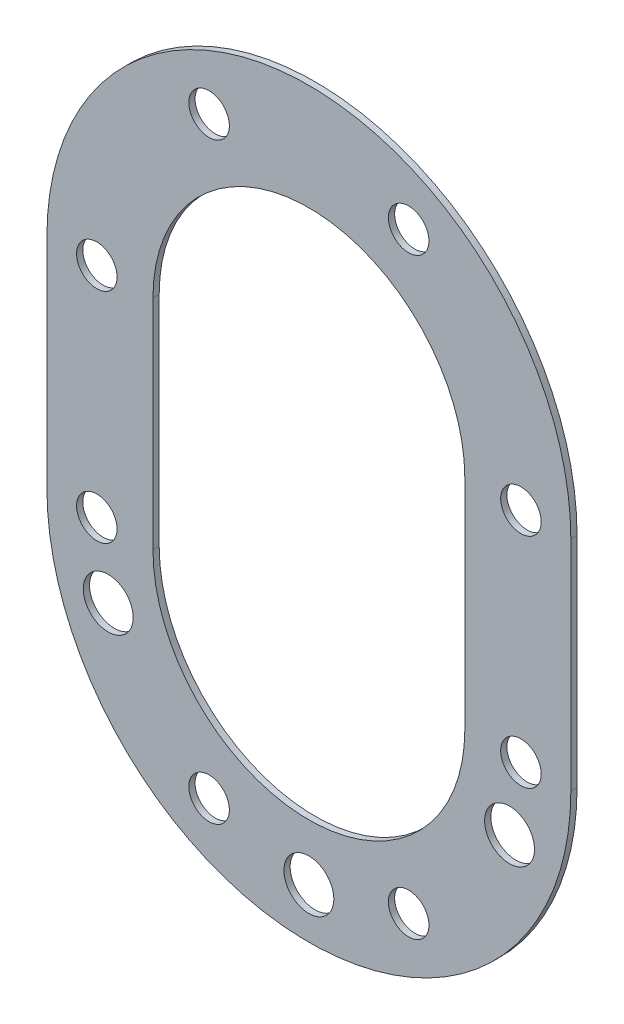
ISO-10303-21;
HEADER;
FILE_DESCRIPTION(('STEP AP214'),'2;1');
FILE_NAME('part.step','',(''),(''),'','','');
FILE_SCHEMA(('AUTOMOTIVE_DESIGN { 1 0 10303 214 1 1 1 1 }'));
ENDSEC;
DATA;
#1=APPLICATION_CONTEXT('core data for automotive mechanical design processes');
#2=APPLICATION_PROTOCOL_DEFINITION('international standard','automotive_design',2000,#1);
#3=PRODUCT_CONTEXT('',#1,'mechanical');
#4=PRODUCT('Part','Part','',(#3));
#5=PRODUCT_RELATED_PRODUCT_CATEGORY('part','',(#4));
#6=PRODUCT_DEFINITION_FORMATION('','',#4);
#7=PRODUCT_DEFINITION_CONTEXT('part definition',#1,'design');
#8=PRODUCT_DEFINITION('design','',#6,#7);
#9=PRODUCT_DEFINITION_SHAPE('','',#8);
#10=(LENGTH_UNIT() NAMED_UNIT(*) SI_UNIT(.MILLI.,.METRE.));
#11=(NAMED_UNIT(*) PLANE_ANGLE_UNIT() SI_UNIT($,.RADIAN.));
#12=(NAMED_UNIT(*) SI_UNIT($,.STERADIAN.) SOLID_ANGLE_UNIT());
#13=UNCERTAINTY_MEASURE_WITH_UNIT(LENGTH_MEASURE(1.E-05),#10,'distance_accuracy_value','');
#14=(GEOMETRIC_REPRESENTATION_CONTEXT(3) GLOBAL_UNCERTAINTY_ASSIGNED_CONTEXT((#13)) GLOBAL_UNIT_ASSIGNED_CONTEXT((#10,
#11,#12)) REPRESENTATION_CONTEXT('',''));
#15=CARTESIAN_POINT('',(0.,0.,0.));
#16=DIRECTION('',(0.,0.,1.));
#17=DIRECTION('',(1.,0.,0.));
#18=AXIS2_PLACEMENT_3D('',#15,#16,#17);
#19=CARTESIAN_POINT('',(0.,0.,1.));
#20=DIRECTION('',(0.,0.,1.));
#21=DIRECTION('',(1.,0.,0.));
#22=AXIS2_PLACEMENT_3D('',#19,#20,#21);
#23=PLANE('',#22);
#24=CARTESIAN_POINT('',(0.,-69.,1.));
#25=DIRECTION('',(0.,0.,1.));
#26=DIRECTION('',(1.,0.,0.));
#27=AXIS2_PLACEMENT_3D('',#24,#25,#26);
#28=CIRCLE('',#27,4.);
#29=CARTESIAN_POINT('',(4.00000000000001,-69.,1.));
#30=VERTEX_POINT('',#29);
#31=EDGE_CURVE('E275',#30,#30,#28,.T.);
#32=ORIENTED_EDGE('',*,*,#31,.F.);
#33=EDGE_LOOP('',(#32));
#34=FACE_BOUND('',#33,.T.);
#35=CARTESIAN_POINT('',(34.,-35.,1.));
#36=DIRECTION('',(0.,0.,1.));
#37=DIRECTION('',(1.,0.,0.));
#38=AXIS2_PLACEMENT_3D('',#35,#36,#37);
#39=CIRCLE('',#38,3.25);
#40=CARTESIAN_POINT('',(37.25,-35.,1.));
#41=VERTEX_POINT('',#40);
#42=EDGE_CURVE('E284',#41,#41,#39,.T.);
#43=ORIENTED_EDGE('',*,*,#42,.F.);
#44=EDGE_LOOP('',(#43));
#45=FACE_BOUND('',#44,.T.);
#46=CARTESIAN_POINT('',(-34.,0.,1.));
#47=DIRECTION('',(0.,0.,1.));
#48=DIRECTION('',(1.,0.,0.));
#49=AXIS2_PLACEMENT_3D('',#46,#47,#48);
#50=CIRCLE('',#49,3.25);
#51=CARTESIAN_POINT('',(-30.75,0.,1.));
#52=VERTEX_POINT('',#51);
#53=EDGE_CURVE('E298',#52,#52,#50,.T.);
#54=ORIENTED_EDGE('',*,*,#53,.F.);
#55=EDGE_LOOP('',(#54));
#56=FACE_BOUND('',#55,.T.);
#57=CARTESIAN_POINT('',(-16.,-65.,1.));
#58=DIRECTION('',(0.,0.,1.));
#59=DIRECTION('',(1.,0.,0.));
#60=AXIS2_PLACEMENT_3D('',#57,#58,#59);
#61=CIRCLE('',#60,3.25);
#62=CARTESIAN_POINT('',(-12.75,-65.,1.));
#63=VERTEX_POINT('',#62);
#64=EDGE_CURVE('E310',#63,#63,#61,.T.);
#65=ORIENTED_EDGE('',*,*,#64,.F.);
#66=EDGE_LOOP('',(#65));
#67=FACE_BOUND('',#66,.T.);
#68=CARTESIAN_POINT('',(16.,30.,1.));
#69=DIRECTION('',(0.,0.,1.));
#70=DIRECTION('',(1.,0.,0.));
#71=AXIS2_PLACEMENT_3D('',#68,#69,#70);
#72=CIRCLE('',#71,3.25);
#73=CARTESIAN_POINT('',(19.25,30.,1.));
#74=VERTEX_POINT('',#73);
#75=EDGE_CURVE('E322',#74,#74,#72,.T.);
#76=ORIENTED_EDGE('',*,*,#75,.F.);
#77=EDGE_LOOP('',(#76));
#78=FACE_BOUND('',#77,.T.);
#79=DIRECTION('',(0.,-1.,0.));
#80=VECTOR('',#79,1.);
#81=CARTESIAN_POINT('',(-25.,0.,1.));
#82=LINE('',#81,#80);
#83=CARTESIAN_POINT('',(-25.,0.,1.));
#84=VERTEX_POINT('',#83);
#85=CARTESIAN_POINT('',(-25.,-35.,1.));
#86=VERTEX_POINT('',#85);
#87=EDGE_CURVE('E107',#84,#86,#82,.T.);
#88=ORIENTED_EDGE('',*,*,#87,.F.);
#89=CARTESIAN_POINT('',(0.,0.,1.));
#90=DIRECTION('',(0.,0.,1.));
#91=DIRECTION('',(1.,0.,0.));
#92=AXIS2_PLACEMENT_3D('',#89,#90,#91);
#93=CIRCLE('',#92,25.);
#94=CARTESIAN_POINT('',(25.,0.,1.));
#95=VERTEX_POINT('',#94);
#96=EDGE_CURVE('E99',#95,#84,#93,.T.);
#97=ORIENTED_EDGE('',*,*,#96,.F.);
#98=DIRECTION('',(0.,1.,0.));
#99=VECTOR('',#98,1.);
#100=CARTESIAN_POINT('',(25.,0.,1.));
#101=LINE('',#100,#99);
#102=CARTESIAN_POINT('',(25.,-35.,1.));
#103=VERTEX_POINT('',#102);
#104=EDGE_CURVE('E122',#103,#95,#101,.T.);
#105=ORIENTED_EDGE('',*,*,#104,.F.);
#106=CARTESIAN_POINT('',(0.,-35.,1.));
#107=DIRECTION('',(0.,0.,1.));
#108=DIRECTION('',(1.,0.,0.));
#109=AXIS2_PLACEMENT_3D('',#106,#107,#108);
#110=CIRCLE('',#109,25.);
#111=EDGE_CURVE('E120',#86,#103,#110,.T.);
#112=ORIENTED_EDGE('',*,*,#111,.F.);
#113=EDGE_LOOP('',(#88,#97,#105,#112));
#114=FACE_BOUND('',#113,.T.);
#115=CARTESIAN_POINT('',(0.,0.,1.));
#116=DIRECTION('',(0.,0.,1.));
#117=DIRECTION('',(1.,0.,0.));
#118=AXIS2_PLACEMENT_3D('',#115,#116,#117);
#119=CIRCLE('',#118,42.);
#120=CARTESIAN_POINT('',(42.,0.,1.));
#121=VERTEX_POINT('',#120);
#122=CARTESIAN_POINT('',(-42.,0.,1.));
#123=VERTEX_POINT('',#122);
#124=EDGE_CURVE('E138',#121,#123,#119,.T.);
#125=ORIENTED_EDGE('',*,*,#124,.T.);
#126=DIRECTION('',(0.,-1.,0.));
#127=VECTOR('',#126,1.);
#128=CARTESIAN_POINT('',(-42.,0.,1.));
#129=LINE('',#128,#127);
#130=CARTESIAN_POINT('',(-42.,-35.,1.));
#131=VERTEX_POINT('',#130);
#132=EDGE_CURVE('E141',#123,#131,#129,.T.);
#133=ORIENTED_EDGE('',*,*,#132,.T.);
#134=CARTESIAN_POINT('',(0.,-35.,1.));
#135=DIRECTION('',(0.,0.,1.));
#136=DIRECTION('',(1.,0.,0.));
#137=AXIS2_PLACEMENT_3D('',#134,#135,#136);
#138=CIRCLE('',#137,42.);
#139=CARTESIAN_POINT('',(42.,-35.,1.));
#140=VERTEX_POINT('',#139);
#141=EDGE_CURVE('E144',#131,#140,#138,.T.);
#142=ORIENTED_EDGE('',*,*,#141,.T.);
#143=DIRECTION('',(0.,1.,0.));
#144=VECTOR('',#143,1.);
#145=CARTESIAN_POINT('',(42.,0.,1.));
#146=LINE('',#145,#144);
#147=EDGE_CURVE('E146',#140,#121,#146,.T.);
#148=ORIENTED_EDGE('',*,*,#147,.T.);
#149=EDGE_LOOP('',(#125,#133,#142,#148));
#150=FACE_BOUND('',#149,.T.);
#151=CARTESIAN_POINT('',(-16.,30.,1.));
#152=DIRECTION('',(0.,0.,1.));
#153=DIRECTION('',(1.,0.,0.));
#154=AXIS2_PLACEMENT_3D('',#151,#152,#153);
#155=CIRCLE('',#154,3.25);
#156=CARTESIAN_POINT('',(-12.75,30.,1.));
#157=VERTEX_POINT('',#156);
#158=EDGE_CURVE('E128',#157,#157,#155,.T.);
#159=ORIENTED_EDGE('',*,*,#158,.F.);
#160=EDGE_LOOP('',(#159));
#161=FACE_BOUND('',#160,.T.);
#162=CARTESIAN_POINT('',(16.,-65.,1.));
#163=DIRECTION('',(0.,0.,1.));
#164=DIRECTION('',(1.,0.,0.));
#165=AXIS2_PLACEMENT_3D('',#162,#163,#164);
#166=CIRCLE('',#165,3.25);
#167=CARTESIAN_POINT('',(19.25,-65.,1.));
#168=VERTEX_POINT('',#167);
#169=EDGE_CURVE('E316',#168,#168,#166,.T.);
#170=ORIENTED_EDGE('',*,*,#169,.F.);
#171=EDGE_LOOP('',(#170));
#172=FACE_BOUND('',#171,.T.);
#173=CARTESIAN_POINT('',(-34.,-35.0000000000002,1.));
#174=DIRECTION('',(0.,0.,1.));
#175=DIRECTION('',(1.,0.,0.));
#176=AXIS2_PLACEMENT_3D('',#173,#174,#175);
#177=CIRCLE('',#176,3.25);
#178=CARTESIAN_POINT('',(-30.75,-35.0000000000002,1.));
#179=VERTEX_POINT('',#178);
#180=EDGE_CURVE('E304',#179,#179,#177,.T.);
#181=ORIENTED_EDGE('',*,*,#180,.F.);
#182=EDGE_LOOP('',(#181));
#183=FACE_BOUND('',#182,.T.);
#184=CARTESIAN_POINT('',(34.,0.,1.));
#185=DIRECTION('',(0.,0.,1.));
#186=DIRECTION('',(1.,0.,0.));
#187=AXIS2_PLACEMENT_3D('',#184,#185,#186);
#188=CIRCLE('',#187,3.25);
#189=CARTESIAN_POINT('',(37.25,0.,1.));
#190=VERTEX_POINT('',#189);
#191=EDGE_CURVE('E292',#190,#190,#188,.T.);
#192=ORIENTED_EDGE('',*,*,#191,.F.);
#193=EDGE_LOOP('',(#192));
#194=FACE_BOUND('',#193,.T.);
#195=CARTESIAN_POINT('',(-32.1714158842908,-46.,1.));
#196=DIRECTION('',(0.,0.,1.));
#197=DIRECTION('',(1.,0.,0.));
#198=AXIS2_PLACEMENT_3D('',#195,#196,#197);
#199=CIRCLE('',#198,4.);
#200=CARTESIAN_POINT('',(-28.1714158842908,-46.,1.));
#201=VERTEX_POINT('',#200);
#202=EDGE_CURVE('E281',#201,#201,#199,.T.);
#203=ORIENTED_EDGE('',*,*,#202,.F.);
#204=EDGE_LOOP('',(#203));
#205=FACE_BOUND('',#204,.T.);
#206=CARTESIAN_POINT('',(32.1714158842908,-46.,1.));
#207=DIRECTION('',(0.,0.,1.));
#208=DIRECTION('',(1.,0.,0.));
#209=AXIS2_PLACEMENT_3D('',#206,#207,#208);
#210=CIRCLE('',#209,4.);
#211=CARTESIAN_POINT('',(36.1714158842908,-46.,1.));
#212=VERTEX_POINT('',#211);
#213=EDGE_CURVE('E266',#212,#212,#210,.T.);
#214=ORIENTED_EDGE('',*,*,#213,.F.);
#215=EDGE_LOOP('',(#214));
#216=FACE_BOUND('',#215,.T.);
#217=ADVANCED_FACE('F34',(#34,#45,#56,#67,#78,#114,#150,#161,#172,#183,#194,#205,#216),#23,.T.);
#218=CARTESIAN_POINT('',(0.,0.,0.));
#219=DIRECTION('',(0.,0.,1.));
#220=DIRECTION('',(1.,0.,0.));
#221=AXIS2_PLACEMENT_3D('',#218,#219,#220);
#222=PLANE('',#221);
#223=CARTESIAN_POINT('',(0.,-69.,0.));
#224=DIRECTION('',(0.,0.,1.));
#225=DIRECTION('',(1.,0.,0.));
#226=AXIS2_PLACEMENT_3D('',#223,#224,#225);
#227=CIRCLE('',#226,4.);
#228=CARTESIAN_POINT('',(4.00000000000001,-69.,0.));
#229=VERTEX_POINT('',#228);
#230=EDGE_CURVE('E272',#229,#229,#227,.T.);
#231=ORIENTED_EDGE('',*,*,#230,.T.);
#232=EDGE_LOOP('',(#231));
#233=FACE_BOUND('',#232,.T.);
#234=CARTESIAN_POINT('',(34.,-35.,0.));
#235=DIRECTION('',(0.,0.,1.));
#236=DIRECTION('',(1.,0.,0.));
#237=AXIS2_PLACEMENT_3D('',#234,#235,#236);
#238=CIRCLE('',#237,3.25);
#239=CARTESIAN_POINT('',(37.25,-35.,0.));
#240=VERTEX_POINT('',#239);
#241=EDGE_CURVE('E289',#240,#240,#238,.T.);
#242=ORIENTED_EDGE('',*,*,#241,.T.);
#243=EDGE_LOOP('',(#242));
#244=FACE_BOUND('',#243,.T.);
#245=CARTESIAN_POINT('',(-34.,0.,0.));
#246=DIRECTION('',(0.,0.,1.));
#247=DIRECTION('',(1.,0.,0.));
#248=AXIS2_PLACEMENT_3D('',#245,#246,#247);
#249=CIRCLE('',#248,3.25);
#250=CARTESIAN_POINT('',(-30.75,0.,0.));
#251=VERTEX_POINT('',#250);
#252=EDGE_CURVE('E301',#251,#251,#249,.T.);
#253=ORIENTED_EDGE('',*,*,#252,.T.);
#254=EDGE_LOOP('',(#253));
#255=FACE_BOUND('',#254,.T.);
#256=CARTESIAN_POINT('',(-16.,-65.,0.));
#257=DIRECTION('',(0.,0.,1.));
#258=DIRECTION('',(1.,0.,0.));
#259=AXIS2_PLACEMENT_3D('',#256,#257,#258);
#260=CIRCLE('',#259,3.25);
#261=CARTESIAN_POINT('',(-12.75,-65.,0.));
#262=VERTEX_POINT('',#261);
#263=EDGE_CURVE('E313',#262,#262,#260,.T.);
#264=ORIENTED_EDGE('',*,*,#263,.T.);
#265=EDGE_LOOP('',(#264));
#266=FACE_BOUND('',#265,.T.);
#267=CARTESIAN_POINT('',(16.,30.,0.));
#268=DIRECTION('',(0.,0.,1.));
#269=DIRECTION('',(1.,0.,0.));
#270=AXIS2_PLACEMENT_3D('',#267,#268,#269);
#271=CIRCLE('',#270,3.25);
#272=CARTESIAN_POINT('',(19.25,30.,0.));
#273=VERTEX_POINT('',#272);
#274=EDGE_CURVE('E325',#273,#273,#271,.T.);
#275=ORIENTED_EDGE('',*,*,#274,.T.);
#276=EDGE_LOOP('',(#275));
#277=FACE_BOUND('',#276,.T.);
#278=CARTESIAN_POINT('',(0.,0.,0.));
#279=DIRECTION('',(0.,0.,1.));
#280=DIRECTION('',(1.,0.,0.));
#281=AXIS2_PLACEMENT_3D('',#278,#279,#280);
#282=CIRCLE('',#281,25.);
#283=CARTESIAN_POINT('',(25.,0.,0.));
#284=VERTEX_POINT('',#283);
#285=CARTESIAN_POINT('',(-25.,0.,0.));
#286=VERTEX_POINT('',#285);
#287=EDGE_CURVE('E57',#284,#286,#282,.T.);
#288=ORIENTED_EDGE('',*,*,#287,.T.);
#289=DIRECTION('',(0.,-1.,0.));
#290=VECTOR('',#289,1.);
#291=CARTESIAN_POINT('',(-25.,0.,0.));
#292=LINE('',#291,#290);
#293=CARTESIAN_POINT('',(-25.,-35.,0.));
#294=VERTEX_POINT('',#293);
#295=EDGE_CURVE('E114',#286,#294,#292,.T.);
#296=ORIENTED_EDGE('',*,*,#295,.T.);
#297=CARTESIAN_POINT('',(0.,-35.,0.));
#298=DIRECTION('',(0.,0.,1.));
#299=DIRECTION('',(1.,0.,0.));
#300=AXIS2_PLACEMENT_3D('',#297,#298,#299);
#301=CIRCLE('',#300,25.);
#302=CARTESIAN_POINT('',(25.,-35.,0.));
#303=VERTEX_POINT('',#302);
#304=EDGE_CURVE('E130',#294,#303,#301,.T.);
#305=ORIENTED_EDGE('',*,*,#304,.T.);
#306=DIRECTION('',(0.,1.,0.));
#307=VECTOR('',#306,1.);
#308=CARTESIAN_POINT('',(25.,0.,0.));
#309=LINE('',#308,#307);
#310=EDGE_CURVE('E108',#303,#284,#309,.T.);
#311=ORIENTED_EDGE('',*,*,#310,.T.);
#312=EDGE_LOOP('',(#288,#296,#305,#311));
#313=FACE_BOUND('',#312,.T.);
#314=CARTESIAN_POINT('',(0.,0.,0.));
#315=DIRECTION('',(0.,0.,1.));
#316=DIRECTION('',(1.,0.,0.));
#317=AXIS2_PLACEMENT_3D('',#314,#315,#316);
#318=CIRCLE('',#317,42.);
#319=CARTESIAN_POINT('',(42.,0.,0.));
#320=VERTEX_POINT('',#319);
#321=CARTESIAN_POINT('',(-42.,0.,0.));
#322=VERTEX_POINT('',#321);
#323=EDGE_CURVE('E115',#320,#322,#318,.T.);
#324=ORIENTED_EDGE('',*,*,#323,.F.);
#325=DIRECTION('',(0.,1.,0.));
#326=VECTOR('',#325,1.);
#327=CARTESIAN_POINT('',(42.,0.,0.));
#328=LINE('',#327,#326);
#329=CARTESIAN_POINT('',(42.,-35.,0.));
#330=VERTEX_POINT('',#329);
#331=EDGE_CURVE('E142',#330,#320,#328,.T.);
#332=ORIENTED_EDGE('',*,*,#331,.F.);
#333=CARTESIAN_POINT('',(0.,-35.,0.));
#334=DIRECTION('',(0.,0.,1.));
#335=DIRECTION('',(1.,0.,0.));
#336=AXIS2_PLACEMENT_3D('',#333,#334,#335);
#337=CIRCLE('',#336,42.);
#338=CARTESIAN_POINT('',(-42.,-35.,0.));
#339=VERTEX_POINT('',#338);
#340=EDGE_CURVE('E153',#339,#330,#337,.T.);
#341=ORIENTED_EDGE('',*,*,#340,.F.);
#342=DIRECTION('',(0.,-1.,0.));
#343=VECTOR('',#342,1.);
#344=CARTESIAN_POINT('',(-42.,0.,0.));
#345=LINE('',#344,#343);
#346=EDGE_CURVE('E151',#322,#339,#345,.T.);
#347=ORIENTED_EDGE('',*,*,#346,.F.);
#348=EDGE_LOOP('',(#324,#332,#341,#347));
#349=FACE_BOUND('',#348,.T.);
#350=CARTESIAN_POINT('',(-16.,30.,0.));
#351=DIRECTION('',(0.,0.,1.));
#352=DIRECTION('',(1.,0.,0.));
#353=AXIS2_PLACEMENT_3D('',#350,#351,#352);
#354=CIRCLE('',#353,3.25);
#355=CARTESIAN_POINT('',(-12.75,30.,0.));
#356=VERTEX_POINT('',#355);
#357=EDGE_CURVE('E328',#356,#356,#354,.T.);
#358=ORIENTED_EDGE('',*,*,#357,.T.);
#359=EDGE_LOOP('',(#358));
#360=FACE_BOUND('',#359,.T.);
#361=CARTESIAN_POINT('',(16.,-65.,0.));
#362=DIRECTION('',(0.,0.,1.));
#363=DIRECTION('',(1.,0.,0.));
#364=AXIS2_PLACEMENT_3D('',#361,#362,#363);
#365=CIRCLE('',#364,3.25);
#366=CARTESIAN_POINT('',(19.25,-65.,0.));
#367=VERTEX_POINT('',#366);
#368=EDGE_CURVE('E319',#367,#367,#365,.T.);
#369=ORIENTED_EDGE('',*,*,#368,.T.);
#370=EDGE_LOOP('',(#369));
#371=FACE_BOUND('',#370,.T.);
#372=CARTESIAN_POINT('',(-34.,-35.0000000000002,0.));
#373=DIRECTION('',(0.,0.,1.));
#374=DIRECTION('',(1.,0.,0.));
#375=AXIS2_PLACEMENT_3D('',#372,#373,#374);
#376=CIRCLE('',#375,3.25);
#377=CARTESIAN_POINT('',(-30.75,-35.0000000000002,0.));
#378=VERTEX_POINT('',#377);
#379=EDGE_CURVE('E307',#378,#378,#376,.T.);
#380=ORIENTED_EDGE('',*,*,#379,.T.);
#381=EDGE_LOOP('',(#380));
#382=FACE_BOUND('',#381,.T.);
#383=CARTESIAN_POINT('',(34.,0.,0.));
#384=DIRECTION('',(0.,0.,1.));
#385=DIRECTION('',(1.,0.,0.));
#386=AXIS2_PLACEMENT_3D('',#383,#384,#385);
#387=CIRCLE('',#386,3.25);
#388=CARTESIAN_POINT('',(37.25,0.,0.));
#389=VERTEX_POINT('',#388);
#390=EDGE_CURVE('E295',#389,#389,#387,.T.);
#391=ORIENTED_EDGE('',*,*,#390,.T.);
#392=EDGE_LOOP('',(#391));
#393=FACE_BOUND('',#392,.T.);
#394=CARTESIAN_POINT('',(-32.1714158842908,-46.,0.));
#395=DIRECTION('',(0.,0.,1.));
#396=DIRECTION('',(1.,0.,0.));
#397=AXIS2_PLACEMENT_3D('',#394,#395,#396);
#398=CIRCLE('',#397,4.);
#399=CARTESIAN_POINT('',(-28.1714158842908,-46.,0.));
#400=VERTEX_POINT('',#399);
#401=EDGE_CURVE('E278',#400,#400,#398,.T.);
#402=ORIENTED_EDGE('',*,*,#401,.T.);
#403=EDGE_LOOP('',(#402));
#404=FACE_BOUND('',#403,.T.);
#405=CARTESIAN_POINT('',(32.1714158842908,-46.,0.));
#406=DIRECTION('',(0.,0.,1.));
#407=DIRECTION('',(1.,0.,0.));
#408=AXIS2_PLACEMENT_3D('',#405,#406,#407);
#409=CIRCLE('',#408,4.);
#410=CARTESIAN_POINT('',(36.1714158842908,-46.,0.));
#411=VERTEX_POINT('',#410);
#412=EDGE_CURVE('E269',#411,#411,#409,.T.);
#413=ORIENTED_EDGE('',*,*,#412,.T.);
#414=EDGE_LOOP('',(#413));
#415=FACE_BOUND('',#414,.T.);
#416=ADVANCED_FACE('F171',(#233,#244,#255,#266,#277,#313,#349,#360,#371,#382,#393,#404,#415),
#222,.F.);
#417=CARTESIAN_POINT('',(0.,0.,1.));
#418=DIRECTION('',(0.,0.,-1.));
#419=DIRECTION('',(-1.,0.,0.));
#420=AXIS2_PLACEMENT_3D('',#417,#418,#419);
#421=CYLINDRICAL_SURFACE('',#420,42.);
#422=ORIENTED_EDGE('',*,*,#323,.T.);
#423=DIRECTION('',(0.,0.,-1.));
#424=VECTOR('',#423,1.);
#425=CARTESIAN_POINT('',(-42.,0.,1.));
#426=LINE('',#425,#424);
#427=EDGE_CURVE('E11',#123,#322,#426,.T.);
#428=ORIENTED_EDGE('',*,*,#427,.F.);
#429=ORIENTED_EDGE('',*,*,#124,.F.);
#430=DIRECTION('',(0.,0.,-1.));
#431=VECTOR('',#430,1.);
#432=CARTESIAN_POINT('',(42.,0.,1.));
#433=LINE('',#432,#431);
#434=EDGE_CURVE('E148',#121,#320,#433,.T.);
#435=ORIENTED_EDGE('',*,*,#434,.T.);
#436=EDGE_LOOP('',(#422,#428,#429,#435));
#437=FACE_BOUND('',#436,.T.);
#438=ADVANCED_FACE('F36',(#437),#421,.T.);
#439=CARTESIAN_POINT('',(-42.,0.,1.));
#440=DIRECTION('',(1.,0.,0.));
#441=DIRECTION('',(0.,1.,0.));
#442=AXIS2_PLACEMENT_3D('',#439,#440,#441);
#443=PLANE('',#442);
#444=ORIENTED_EDGE('',*,*,#346,.T.);
#445=DIRECTION('',(0.,0.,-1.));
#446=VECTOR('',#445,1.);
#447=CARTESIAN_POINT('',(-42.,-35.,1.));
#448=LINE('',#447,#446);
#449=EDGE_CURVE('E42',#131,#339,#448,.T.);
#450=ORIENTED_EDGE('',*,*,#449,.F.);
#451=ORIENTED_EDGE('',*,*,#132,.F.);
#452=ORIENTED_EDGE('',*,*,#427,.T.);
#453=EDGE_LOOP('',(#444,#450,#451,#452));
#454=FACE_BOUND('',#453,.T.);
#455=ADVANCED_FACE('F181',(#454),#443,.F.);
#456=CARTESIAN_POINT('',(0.,-35.,1.));
#457=DIRECTION('',(0.,0.,-1.));
#458=DIRECTION('',(-1.,0.,0.));
#459=AXIS2_PLACEMENT_3D('',#456,#457,#458);
#460=CYLINDRICAL_SURFACE('',#459,42.);
#461=ORIENTED_EDGE('',*,*,#340,.T.);
#462=DIRECTION('',(0.,0.,-1.));
#463=VECTOR('',#462,1.);
#464=CARTESIAN_POINT('',(42.,-35.,1.));
#465=LINE('',#464,#463);
#466=EDGE_CURVE('E158',#140,#330,#465,.T.);
#467=ORIENTED_EDGE('',*,*,#466,.F.);
#468=ORIENTED_EDGE('',*,*,#141,.F.);
#469=ORIENTED_EDGE('',*,*,#449,.T.);
#470=EDGE_LOOP('',(#461,#467,#468,#469));
#471=FACE_BOUND('',#470,.T.);
#472=ADVANCED_FACE('F165',(#471),#460,.T.);
#473=CARTESIAN_POINT('',(42.,0.,1.));
#474=DIRECTION('',(-1.,0.,0.));
#475=DIRECTION('',(0.,-1.,0.));
#476=AXIS2_PLACEMENT_3D('',#473,#474,#475);
#477=PLANE('',#476);
#478=ORIENTED_EDGE('',*,*,#331,.T.);
#479=ORIENTED_EDGE('',*,*,#434,.F.);
#480=ORIENTED_EDGE('',*,*,#147,.F.);
#481=ORIENTED_EDGE('',*,*,#466,.T.);
#482=EDGE_LOOP('',(#478,#479,#480,#481));
#483=FACE_BOUND('',#482,.T.);
#484=ADVANCED_FACE('F175',(#483),#477,.F.);
#485=CARTESIAN_POINT('',(0.,0.,1.));
#486=DIRECTION('',(0.,0.,-1.));
#487=DIRECTION('',(-1.,0.,0.));
#488=AXIS2_PLACEMENT_3D('',#485,#486,#487);
#489=CYLINDRICAL_SURFACE('',#488,25.);
#490=ORIENTED_EDGE('',*,*,#287,.F.);
#491=DIRECTION('',(0.,0.,-1.));
#492=VECTOR('',#491,1.);
#493=CARTESIAN_POINT('',(25.,0.,1.));
#494=LINE('',#493,#492);
#495=EDGE_CURVE('E103',#95,#284,#494,.T.);
#496=ORIENTED_EDGE('',*,*,#495,.F.);
#497=ORIENTED_EDGE('',*,*,#96,.T.);
#498=DIRECTION('',(0.,0.,-1.));
#499=VECTOR('',#498,1.);
#500=CARTESIAN_POINT('',(-25.,0.,1.));
#501=LINE('',#500,#499);
#502=EDGE_CURVE('E102',#84,#286,#501,.T.);
#503=ORIENTED_EDGE('',*,*,#502,.T.);
#504=EDGE_LOOP('',(#490,#496,#497,#503));
#505=FACE_BOUND('',#504,.T.);
#506=ADVANCED_FACE('F101',(#505),#489,.F.);
#507=CARTESIAN_POINT('',(-25.,0.,1.));
#508=DIRECTION('',(1.,0.,0.));
#509=DIRECTION('',(0.,1.,0.));
#510=AXIS2_PLACEMENT_3D('',#507,#508,#509);
#511=PLANE('',#510);
#512=ORIENTED_EDGE('',*,*,#295,.F.);
#513=ORIENTED_EDGE('',*,*,#502,.F.);
#514=ORIENTED_EDGE('',*,*,#87,.T.);
#515=DIRECTION('',(0.,0.,-1.));
#516=VECTOR('',#515,1.);
#517=CARTESIAN_POINT('',(-25.,-35.,1.));
#518=LINE('',#517,#516);
#519=EDGE_CURVE('E116',#86,#294,#518,.T.);
#520=ORIENTED_EDGE('',*,*,#519,.T.);
#521=EDGE_LOOP('',(#512,#513,#514,#520));
#522=FACE_BOUND('',#521,.T.);
#523=ADVANCED_FACE('F111',(#522),#511,.T.);
#524=CARTESIAN_POINT('',(0.,-35.,1.));
#525=DIRECTION('',(0.,0.,-1.));
#526=DIRECTION('',(-1.,0.,0.));
#527=AXIS2_PLACEMENT_3D('',#524,#525,#526);
#528=CYLINDRICAL_SURFACE('',#527,25.);
#529=ORIENTED_EDGE('',*,*,#304,.F.);
#530=ORIENTED_EDGE('',*,*,#519,.F.);
#531=ORIENTED_EDGE('',*,*,#111,.T.);
#532=DIRECTION('',(0.,0.,-1.));
#533=VECTOR('',#532,1.);
#534=CARTESIAN_POINT('',(25.,-35.,1.));
#535=LINE('',#534,#533);
#536=EDGE_CURVE('E49',#103,#303,#535,.T.);
#537=ORIENTED_EDGE('',*,*,#536,.T.);
#538=EDGE_LOOP('',(#529,#530,#531,#537));
#539=FACE_BOUND('',#538,.T.);
#540=ADVANCED_FACE('F208',(#539),#528,.F.);
#541=CARTESIAN_POINT('',(25.,0.,1.));
#542=DIRECTION('',(-1.,0.,0.));
#543=DIRECTION('',(0.,-1.,0.));
#544=AXIS2_PLACEMENT_3D('',#541,#542,#543);
#545=PLANE('',#544);
#546=ORIENTED_EDGE('',*,*,#310,.F.);
#547=ORIENTED_EDGE('',*,*,#536,.F.);
#548=ORIENTED_EDGE('',*,*,#104,.T.);
#549=ORIENTED_EDGE('',*,*,#495,.T.);
#550=EDGE_LOOP('',(#546,#547,#548,#549));
#551=FACE_BOUND('',#550,.T.);
#552=ADVANCED_FACE('F212',(#551),#545,.T.);
#553=CARTESIAN_POINT('',(-16.,30.,1.));
#554=DIRECTION('',(0.,0.,-1.));
#555=DIRECTION('',(-1.,0.,0.));
#556=AXIS2_PLACEMENT_3D('',#553,#554,#555);
#557=CYLINDRICAL_SURFACE('',#556,3.25);
#558=ORIENTED_EDGE('',*,*,#158,.T.);
#559=EDGE_LOOP('',(#558));
#560=FACE_BOUND('',#559,.T.);
#561=ORIENTED_EDGE('',*,*,#357,.F.);
#562=EDGE_LOOP('',(#561));
#563=FACE_BOUND('',#562,.T.);
#564=ADVANCED_FACE('F218',(#560,#563),#557,.F.);
#565=CARTESIAN_POINT('',(16.,30.,1.));
#566=DIRECTION('',(0.,0.,-1.));
#567=DIRECTION('',(-1.,0.,0.));
#568=AXIS2_PLACEMENT_3D('',#565,#566,#567);
#569=CYLINDRICAL_SURFACE('',#568,3.25);
#570=ORIENTED_EDGE('',*,*,#75,.T.);
#571=EDGE_LOOP('',(#570));
#572=FACE_BOUND('',#571,.T.);
#573=ORIENTED_EDGE('',*,*,#274,.F.);
#574=EDGE_LOOP('',(#573));
#575=FACE_BOUND('',#574,.T.);
#576=ADVANCED_FACE('F221',(#572,#575),#569,.F.);
#577=CARTESIAN_POINT('',(16.,-65.,1.));
#578=DIRECTION('',(0.,0.,-1.));
#579=DIRECTION('',(-1.,0.,0.));
#580=AXIS2_PLACEMENT_3D('',#577,#578,#579);
#581=CYLINDRICAL_SURFACE('',#580,3.25);
#582=ORIENTED_EDGE('',*,*,#169,.T.);
#583=EDGE_LOOP('',(#582));
#584=FACE_BOUND('',#583,.T.);
#585=ORIENTED_EDGE('',*,*,#368,.F.);
#586=EDGE_LOOP('',(#585));
#587=FACE_BOUND('',#586,.T.);
#588=ADVANCED_FACE('F225',(#584,#587),#581,.F.);
#589=CARTESIAN_POINT('',(-16.,-65.,1.));
#590=DIRECTION('',(0.,0.,-1.));
#591=DIRECTION('',(-1.,0.,0.));
#592=AXIS2_PLACEMENT_3D('',#589,#590,#591);
#593=CYLINDRICAL_SURFACE('',#592,3.25);
#594=ORIENTED_EDGE('',*,*,#64,.T.);
#595=EDGE_LOOP('',(#594));
#596=FACE_BOUND('',#595,.T.);
#597=ORIENTED_EDGE('',*,*,#263,.F.);
#598=EDGE_LOOP('',(#597));
#599=FACE_BOUND('',#598,.T.);
#600=ADVANCED_FACE('F229',(#596,#599),#593,.F.);
#601=CARTESIAN_POINT('',(-34.,-35.0000000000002,1.));
#602=DIRECTION('',(0.,0.,-1.));
#603=DIRECTION('',(-1.,0.,0.));
#604=AXIS2_PLACEMENT_3D('',#601,#602,#603);
#605=CYLINDRICAL_SURFACE('',#604,3.25);
#606=ORIENTED_EDGE('',*,*,#180,.T.);
#607=EDGE_LOOP('',(#606));
#608=FACE_BOUND('',#607,.T.);
#609=ORIENTED_EDGE('',*,*,#379,.F.);
#610=EDGE_LOOP('',(#609));
#611=FACE_BOUND('',#610,.T.);
#612=ADVANCED_FACE('F233',(#608,#611),#605,.F.);
#613=CARTESIAN_POINT('',(-34.,0.,1.));
#614=DIRECTION('',(0.,0.,-1.));
#615=DIRECTION('',(-1.,0.,0.));
#616=AXIS2_PLACEMENT_3D('',#613,#614,#615);
#617=CYLINDRICAL_SURFACE('',#616,3.25);
#618=ORIENTED_EDGE('',*,*,#53,.T.);
#619=EDGE_LOOP('',(#618));
#620=FACE_BOUND('',#619,.T.);
#621=ORIENTED_EDGE('',*,*,#252,.F.);
#622=EDGE_LOOP('',(#621));
#623=FACE_BOUND('',#622,.T.);
#624=ADVANCED_FACE('F237',(#620,#623),#617,.F.);
#625=CARTESIAN_POINT('',(34.,0.,1.));
#626=DIRECTION('',(0.,0.,-1.));
#627=DIRECTION('',(-1.,0.,0.));
#628=AXIS2_PLACEMENT_3D('',#625,#626,#627);
#629=CYLINDRICAL_SURFACE('',#628,3.25);
#630=ORIENTED_EDGE('',*,*,#191,.T.);
#631=EDGE_LOOP('',(#630));
#632=FACE_BOUND('',#631,.T.);
#633=ORIENTED_EDGE('',*,*,#390,.F.);
#634=EDGE_LOOP('',(#633));
#635=FACE_BOUND('',#634,.T.);
#636=ADVANCED_FACE('F241',(#632,#635),#629,.F.);
#637=CARTESIAN_POINT('',(34.,-35.,1.));
#638=DIRECTION('',(0.,0.,-1.));
#639=DIRECTION('',(-1.,0.,0.));
#640=AXIS2_PLACEMENT_3D('',#637,#638,#639);
#641=CYLINDRICAL_SURFACE('',#640,3.25);
#642=ORIENTED_EDGE('',*,*,#42,.T.);
#643=EDGE_LOOP('',(#642));
#644=FACE_BOUND('',#643,.T.);
#645=ORIENTED_EDGE('',*,*,#241,.F.);
#646=EDGE_LOOP('',(#645));
#647=FACE_BOUND('',#646,.T.);
#648=ADVANCED_FACE('F245',(#644,#647),#641,.F.);
#649=CARTESIAN_POINT('',(-32.1714158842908,-46.,1.));
#650=DIRECTION('',(0.,0.,-1.));
#651=DIRECTION('',(-1.,0.,0.));
#652=AXIS2_PLACEMENT_3D('',#649,#650,#651);
#653=CYLINDRICAL_SURFACE('',#652,4.);
#654=ORIENTED_EDGE('',*,*,#202,.T.);
#655=EDGE_LOOP('',(#654));
#656=FACE_BOUND('',#655,.T.);
#657=ORIENTED_EDGE('',*,*,#401,.F.);
#658=EDGE_LOOP('',(#657));
#659=FACE_BOUND('',#658,.T.);
#660=ADVANCED_FACE('F249',(#656,#659),#653,.F.);
#661=CARTESIAN_POINT('',(0.,-69.,1.));
#662=DIRECTION('',(0.,0.,-1.));
#663=DIRECTION('',(-1.,0.,0.));
#664=AXIS2_PLACEMENT_3D('',#661,#662,#663);
#665=CYLINDRICAL_SURFACE('',#664,4.);
#666=ORIENTED_EDGE('',*,*,#31,.T.);
#667=EDGE_LOOP('',(#666));
#668=FACE_BOUND('',#667,.T.);
#669=ORIENTED_EDGE('',*,*,#230,.F.);
#670=EDGE_LOOP('',(#669));
#671=FACE_BOUND('',#670,.T.);
#672=ADVANCED_FACE('F253',(#668,#671),#665,.F.);
#673=CARTESIAN_POINT('',(32.1714158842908,-46.,1.));
#674=DIRECTION('',(0.,0.,-1.));
#675=DIRECTION('',(-1.,0.,0.));
#676=AXIS2_PLACEMENT_3D('',#673,#674,#675);
#677=CYLINDRICAL_SURFACE('',#676,4.);
#678=ORIENTED_EDGE('',*,*,#213,.T.);
#679=EDGE_LOOP('',(#678));
#680=FACE_BOUND('',#679,.T.);
#681=ORIENTED_EDGE('',*,*,#412,.F.);
#682=EDGE_LOOP('',(#681));
#683=FACE_BOUND('',#682,.T.);
#684=ADVANCED_FACE('F257',(#680,#683),#677,.F.);
#685=CLOSED_SHELL('',(#217,#416,#438,#455,#472,#484,#506,#523,#540,#552,#564,#576,#588,#600,
#612,#624,#636,#648,#660,#672,#684));
#686=MANIFOLD_SOLID_BREP('B2',#685);
#687=ADVANCED_BREP_SHAPE_REPRESENTATION('',(#18,#686),#14);
#688=SHAPE_DEFINITION_REPRESENTATION(#9,#687);
ENDSEC;
END-ISO-10303-21;
